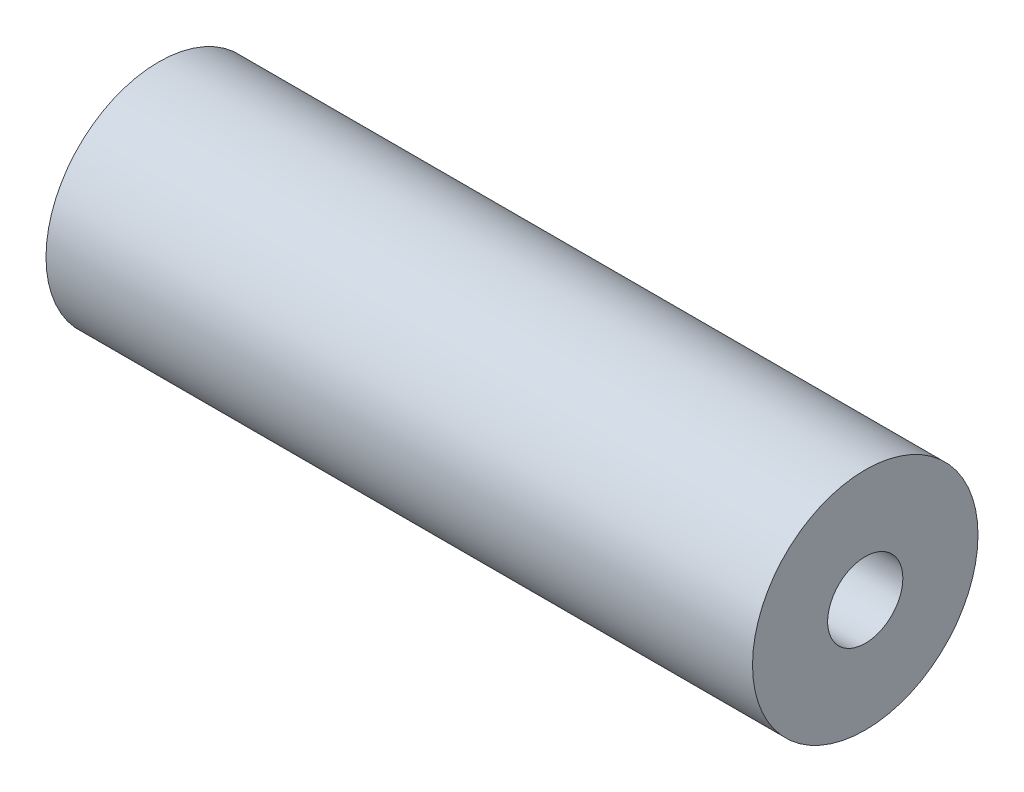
from build123d import *

# Parameters (mm, degrees)
SKETCH1_R           = 7.5
SKETCH1_R_2         = 2.5
BOSS_EXTRUDE1_DEPTH = 47


with BuildPart() as part:
    # Sketch1 → Boss-Extrude1 (new body)
    with BuildSketch(Plane(origin=(0, 0, 0), x_dir=(0, 0, -1), z_dir=(1, 0, 0))):
        Circle(SKETCH1_R)
        Circle(SKETCH1_R_2, mode=Mode.SUBTRACT)
    extrude(amount=BOSS_EXTRUDE1_DEPTH)


solid = part.part
